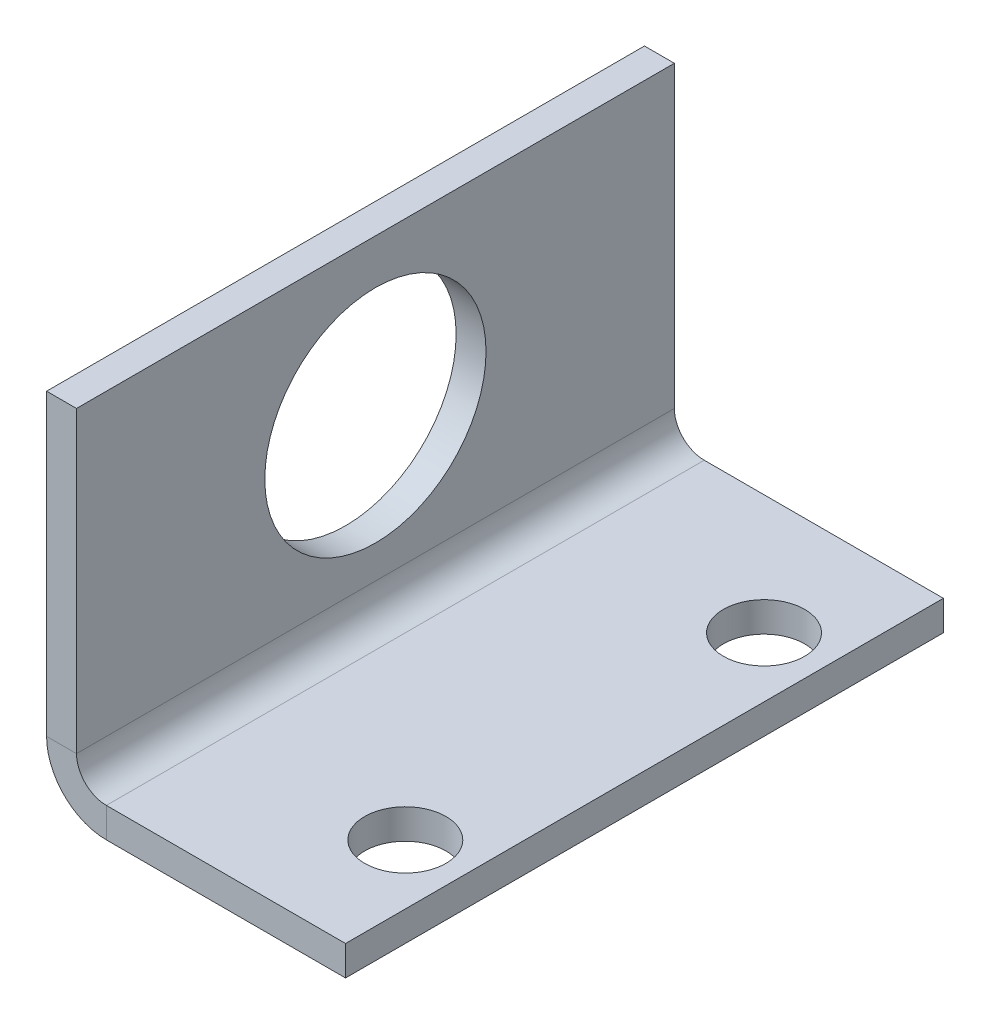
ISO-10303-21;
HEADER;
FILE_DESCRIPTION(('STEP AP214'),'2;1');
FILE_NAME('part.step','',(''),(''),'','','');
FILE_SCHEMA(('AUTOMOTIVE_DESIGN { 1 0 10303 214 1 1 1 1 }'));
ENDSEC;
DATA;
#1=APPLICATION_CONTEXT('core data for automotive mechanical design processes');
#2=APPLICATION_PROTOCOL_DEFINITION('international standard','automotive_design',2000,#1);
#3=PRODUCT_CONTEXT('',#1,'mechanical');
#4=PRODUCT('Part','Part','',(#3));
#5=PRODUCT_RELATED_PRODUCT_CATEGORY('part','',(#4));
#6=PRODUCT_DEFINITION_FORMATION('','',#4);
#7=PRODUCT_DEFINITION_CONTEXT('part definition',#1,'design');
#8=PRODUCT_DEFINITION('design','',#6,#7);
#9=PRODUCT_DEFINITION_SHAPE('','',#8);
#10=(LENGTH_UNIT() NAMED_UNIT(*) SI_UNIT(.MILLI.,.METRE.));
#11=(NAMED_UNIT(*) PLANE_ANGLE_UNIT() SI_UNIT($,.RADIAN.));
#12=(NAMED_UNIT(*) SI_UNIT($,.STERADIAN.) SOLID_ANGLE_UNIT());
#13=UNCERTAINTY_MEASURE_WITH_UNIT(LENGTH_MEASURE(1.E-05),#10,'distance_accuracy_value','');
#14=(GEOMETRIC_REPRESENTATION_CONTEXT(3) GLOBAL_UNCERTAINTY_ASSIGNED_CONTEXT((#13)) GLOBAL_UNIT_ASSIGNED_CONTEXT((#10,
#11,#12)) REPRESENTATION_CONTEXT('',''));
#15=CARTESIAN_POINT('',(0.,0.,0.));
#16=DIRECTION('',(0.,0.,1.));
#17=DIRECTION('',(1.,0.,0.));
#18=AXIS2_PLACEMENT_3D('',#15,#16,#17);
#19=CARTESIAN_POINT('',(0.,5.,50.));
#20=DIRECTION('',(0.,0.,1.));
#21=DIRECTION('',(1.,0.,0.));
#22=AXIS2_PLACEMENT_3D('',#19,#20,#21);
#23=PLANE('',#22);
#24=DIRECTION('',(1.,0.,0.));
#25=VECTOR('',#24,1.);
#26=CARTESIAN_POINT('',(0.,5.,50.));
#27=LINE('',#26,#25);
#28=CARTESIAN_POINT('',(0.,5.,50.));
#29=VERTEX_POINT('',#28);
#30=CARTESIAN_POINT('',(2.5,5.,50.));
#31=VERTEX_POINT('',#30);
#32=EDGE_CURVE('E11',#29,#31,#27,.T.);
#33=ORIENTED_EDGE('',*,*,#32,.F.);
#34=CARTESIAN_POINT('',(5.,5.,50.));
#35=DIRECTION('',(0.,0.,-1.));
#36=DIRECTION('',(-1.,0.,0.));
#37=AXIS2_PLACEMENT_3D('',#34,#35,#36);
#38=CIRCLE('',#37,5.);
#39=CARTESIAN_POINT('',(5.,0.,50.));
#40=VERTEX_POINT('',#39);
#41=EDGE_CURVE('E182',#29,#40,#38,.F.);
#42=ORIENTED_EDGE('',*,*,#41,.T.);
#43=DIRECTION('',(0.,-1.,0.));
#44=VECTOR('',#43,1.);
#45=CARTESIAN_POINT('',(5.,2.5,50.));
#46=LINE('',#45,#44);
#47=CARTESIAN_POINT('',(5.,2.5,50.));
#48=VERTEX_POINT('',#47);
#49=EDGE_CURVE('E48',#48,#40,#46,.T.);
#50=ORIENTED_EDGE('',*,*,#49,.F.);
#51=CARTESIAN_POINT('',(5.,5.,50.));
#52=DIRECTION('',(0.,0.,1.));
#53=DIRECTION('',(1.,0.,0.));
#54=AXIS2_PLACEMENT_3D('',#51,#52,#53);
#55=CIRCLE('',#54,2.5);
#56=EDGE_CURVE('E167',#31,#48,#55,.T.);
#57=ORIENTED_EDGE('',*,*,#56,.F.);
#58=EDGE_LOOP('',(#33,#42,#50,#57));
#59=FACE_BOUND('',#58,.T.);
#60=ADVANCED_FACE('F40',(#59),#23,.T.);
#61=CARTESIAN_POINT('',(5.,2.5,50.));
#62=DIRECTION('',(0.,0.,1.));
#63=DIRECTION('',(1.,0.,0.));
#64=AXIS2_PLACEMENT_3D('',#61,#62,#63);
#65=PLANE('',#64);
#66=DIRECTION('',(0.,-1.,0.));
#67=VECTOR('',#66,1.);
#68=CARTESIAN_POINT('',(0.,30.,50.));
#69=LINE('',#68,#67);
#70=CARTESIAN_POINT('',(0.,30.,50.));
#71=VERTEX_POINT('',#70);
#72=EDGE_CURVE('E179',#71,#29,#69,.T.);
#73=ORIENTED_EDGE('',*,*,#72,.T.);
#74=ORIENTED_EDGE('',*,*,#32,.T.);
#75=DIRECTION('',(0.,-1.,0.));
#76=VECTOR('',#75,1.);
#77=CARTESIAN_POINT('',(2.5,30.,50.));
#78=LINE('',#77,#76);
#79=CARTESIAN_POINT('',(2.5,30.,50.));
#80=VERTEX_POINT('',#79);
#81=EDGE_CURVE('E171',#80,#31,#78,.T.);
#82=ORIENTED_EDGE('',*,*,#81,.F.);
#83=DIRECTION('',(1.,0.,0.));
#84=VECTOR('',#83,1.);
#85=CARTESIAN_POINT('',(0.,30.,50.));
#86=LINE('',#85,#84);
#87=EDGE_CURVE('E175',#71,#80,#86,.T.);
#88=ORIENTED_EDGE('',*,*,#87,.F.);
#89=EDGE_LOOP('',(#73,#74,#82,#88));
#90=FACE_BOUND('',#89,.T.);
#91=ADVANCED_FACE('F257',(#90),#65,.T.);
#92=CARTESIAN_POINT('',(5.,0.,0.));
#93=DIRECTION('',(0.,0.,-1.));
#94=DIRECTION('',(-1.,0.,0.));
#95=AXIS2_PLACEMENT_3D('',#92,#93,#94);
#96=PLANE('',#95);
#97=DIRECTION('',(0.,1.,0.));
#98=VECTOR('',#97,1.);
#99=CARTESIAN_POINT('',(5.,0.,0.));
#100=LINE('',#99,#98);
#101=CARTESIAN_POINT('',(5.,0.,0.));
#102=VERTEX_POINT('',#101);
#103=CARTESIAN_POINT('',(5.,2.5,0.));
#104=VERTEX_POINT('',#103);
#105=EDGE_CURVE('E208',#102,#104,#100,.T.);
#106=ORIENTED_EDGE('',*,*,#105,.F.);
#107=CARTESIAN_POINT('',(5.,5.,0.));
#108=DIRECTION('',(0.,0.,-1.));
#109=DIRECTION('',(-1.,0.,0.));
#110=AXIS2_PLACEMENT_3D('',#107,#108,#109);
#111=CIRCLE('',#110,5.);
#112=CARTESIAN_POINT('',(0.,5.,0.));
#113=VERTEX_POINT('',#112);
#114=EDGE_CURVE('E154',#113,#102,#111,.F.);
#115=ORIENTED_EDGE('',*,*,#114,.F.);
#116=DIRECTION('',(-1.,0.,0.));
#117=VECTOR('',#116,1.);
#118=CARTESIAN_POINT('',(2.5,5.,0.));
#119=LINE('',#118,#117);
#120=CARTESIAN_POINT('',(2.5,5.,0.));
#121=VERTEX_POINT('',#120);
#122=EDGE_CURVE('E114',#121,#113,#119,.T.);
#123=ORIENTED_EDGE('',*,*,#122,.F.);
#124=CARTESIAN_POINT('',(5.,5.,0.));
#125=DIRECTION('',(0.,0.,1.));
#126=DIRECTION('',(1.,0.,0.));
#127=AXIS2_PLACEMENT_3D('',#124,#125,#126);
#128=CIRCLE('',#127,2.5);
#129=EDGE_CURVE('E135',#121,#104,#128,.T.);
#130=ORIENTED_EDGE('',*,*,#129,.T.);
#131=EDGE_LOOP('',(#106,#115,#123,#130));
#132=FACE_BOUND('',#131,.T.);
#133=ADVANCED_FACE('F281',(#132),#96,.T.);
#134=CARTESIAN_POINT('',(2.5,5.,0.));
#135=DIRECTION('',(0.,0.,-1.));
#136=DIRECTION('',(-1.,0.,0.));
#137=AXIS2_PLACEMENT_3D('',#134,#135,#136);
#138=PLANE('',#137);
#139=DIRECTION('',(1.,0.,0.));
#140=VECTOR('',#139,1.);
#141=CARTESIAN_POINT('',(0.,0.,0.));
#142=LINE('',#141,#140);
#143=CARTESIAN_POINT('',(25.,0.,0.));
#144=VERTEX_POINT('',#143);
#145=EDGE_CURVE('E119',#102,#144,#142,.T.);
#146=ORIENTED_EDGE('',*,*,#145,.F.);
#147=ORIENTED_EDGE('',*,*,#105,.T.);
#148=DIRECTION('',(1.,0.,0.));
#149=VECTOR('',#148,1.);
#150=CARTESIAN_POINT('',(0.,2.5,0.));
#151=LINE('',#150,#149);
#152=CARTESIAN_POINT('',(25.,2.5,0.));
#153=VERTEX_POINT('',#152);
#154=EDGE_CURVE('E129',#104,#153,#151,.T.);
#155=ORIENTED_EDGE('',*,*,#154,.T.);
#156=DIRECTION('',(0.,-1.,0.));
#157=VECTOR('',#156,1.);
#158=CARTESIAN_POINT('',(25.,2.5,0.));
#159=LINE('',#158,#157);
#160=EDGE_CURVE('E107',#153,#144,#159,.T.);
#161=ORIENTED_EDGE('',*,*,#160,.T.);
#162=EDGE_LOOP('',(#146,#147,#155,#161));
#163=FACE_BOUND('',#162,.T.);
#164=ADVANCED_FACE('F127',(#163),#138,.T.);
#165=CARTESIAN_POINT('',(0.,0.,50.));
#166=DIRECTION('',(0.,1.,0.));
#167=DIRECTION('',(0.,0.,1.));
#168=AXIS2_PLACEMENT_3D('',#165,#166,#167);
#169=PLANE('',#168);
#170=CARTESIAN_POINT('',(20.,0.,10.));
#171=DIRECTION('',(0.,1.,0.));
#172=DIRECTION('',(0.,0.,1.));
#173=AXIS2_PLACEMENT_3D('',#170,#171,#172);
#174=CIRCLE('',#173,3.4);
#175=CARTESIAN_POINT('',(20.,0.,13.4));
#176=VERTEX_POINT('',#175);
#177=EDGE_CURVE('E219',#176,#176,#174,.T.);
#178=ORIENTED_EDGE('',*,*,#177,.T.);
#179=EDGE_LOOP('',(#178));
#180=FACE_BOUND('',#179,.T.);
#181=CARTESIAN_POINT('',(20.,0.,40.));
#182=DIRECTION('',(0.,1.,0.));
#183=DIRECTION('',(0.,0.,1.));
#184=AXIS2_PLACEMENT_3D('',#181,#182,#183);
#185=CIRCLE('',#184,3.4);
#186=CARTESIAN_POINT('',(20.,0.,43.4));
#187=VERTEX_POINT('',#186);
#188=EDGE_CURVE('E125',#187,#187,#185,.T.);
#189=ORIENTED_EDGE('',*,*,#188,.T.);
#190=EDGE_LOOP('',(#189));
#191=FACE_BOUND('',#190,.T.);
#192=ORIENTED_EDGE('',*,*,#145,.T.);
#193=DIRECTION('',(0.,0.,-1.));
#194=VECTOR('',#193,1.);
#195=CARTESIAN_POINT('',(25.,0.,50.));
#196=LINE('',#195,#194);
#197=CARTESIAN_POINT('',(25.,0.,50.));
#198=VERTEX_POINT('',#197);
#199=EDGE_CURVE('E103',#198,#144,#196,.T.);
#200=ORIENTED_EDGE('',*,*,#199,.F.);
#201=DIRECTION('',(1.,0.,0.));
#202=VECTOR('',#201,1.);
#203=CARTESIAN_POINT('',(0.,0.,50.));
#204=LINE('',#203,#202);
#205=EDGE_CURVE('E158',#40,#198,#204,.T.);
#206=ORIENTED_EDGE('',*,*,#205,.F.);
#207=DIRECTION('',(0.,0.,-1.));
#208=VECTOR('',#207,1.);
#209=CARTESIAN_POINT('',(5.,0.,50.));
#210=LINE('',#209,#208);
#211=EDGE_CURVE('E122',#40,#102,#210,.T.);
#212=ORIENTED_EDGE('',*,*,#211,.T.);
#213=EDGE_LOOP('',(#192,#200,#206,#212));
#214=FACE_BOUND('',#213,.T.);
#215=ADVANCED_FACE('F120',(#180,#191,#214),#169,.F.);
#216=CARTESIAN_POINT('',(25.,2.5,50.));
#217=DIRECTION('',(1.,0.,0.));
#218=DIRECTION('',(0.,0.,-1.));
#219=AXIS2_PLACEMENT_3D('',#216,#217,#218);
#220=PLANE('',#219);
#221=ORIENTED_EDGE('',*,*,#160,.F.);
#222=DIRECTION('',(0.,0.,-1.));
#223=VECTOR('',#222,1.);
#224=CARTESIAN_POINT('',(25.,2.5,50.));
#225=LINE('',#224,#223);
#226=CARTESIAN_POINT('',(25.,2.5,50.));
#227=VERTEX_POINT('',#226);
#228=EDGE_CURVE('E115',#227,#153,#225,.T.);
#229=ORIENTED_EDGE('',*,*,#228,.F.);
#230=DIRECTION('',(0.,-1.,0.));
#231=VECTOR('',#230,1.);
#232=CARTESIAN_POINT('',(25.,2.5,50.));
#233=LINE('',#232,#231);
#234=EDGE_CURVE('E110',#227,#198,#233,.T.);
#235=ORIENTED_EDGE('',*,*,#234,.T.);
#236=ORIENTED_EDGE('',*,*,#199,.T.);
#237=EDGE_LOOP('',(#221,#229,#235,#236));
#238=FACE_BOUND('',#237,.T.);
#239=ADVANCED_FACE('F105',(#238),#220,.T.);
#240=CARTESIAN_POINT('',(0.,2.5,50.));
#241=DIRECTION('',(0.,1.,0.));
#242=DIRECTION('',(0.,0.,1.));
#243=AXIS2_PLACEMENT_3D('',#240,#241,#242);
#244=PLANE('',#243);
#245=CARTESIAN_POINT('',(20.,2.5,10.));
#246=DIRECTION('',(0.,1.,0.));
#247=DIRECTION('',(0.,0.,1.));
#248=AXIS2_PLACEMENT_3D('',#245,#246,#247);
#249=CIRCLE('',#248,3.39999999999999);
#250=CARTESIAN_POINT('',(20.,2.5,13.4));
#251=VERTEX_POINT('',#250);
#252=EDGE_CURVE('E228',#251,#251,#249,.T.);
#253=ORIENTED_EDGE('',*,*,#252,.F.);
#254=EDGE_LOOP('',(#253));
#255=FACE_BOUND('',#254,.T.);
#256=CARTESIAN_POINT('',(20.,2.5,40.));
#257=DIRECTION('',(0.,1.,0.));
#258=DIRECTION('',(0.,0.,1.));
#259=AXIS2_PLACEMENT_3D('',#256,#257,#258);
#260=CIRCLE('',#259,3.39999999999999);
#261=CARTESIAN_POINT('',(20.,2.5,43.4));
#262=VERTEX_POINT('',#261);
#263=EDGE_CURVE('E217',#262,#262,#260,.T.);
#264=ORIENTED_EDGE('',*,*,#263,.F.);
#265=EDGE_LOOP('',(#264));
#266=FACE_BOUND('',#265,.T.);
#267=ORIENTED_EDGE('',*,*,#154,.F.);
#268=DIRECTION('',(0.,0.,-1.));
#269=VECTOR('',#268,1.);
#270=CARTESIAN_POINT('',(5.,2.5,50.));
#271=LINE('',#270,#269);
#272=EDGE_CURVE('E201',#48,#104,#271,.T.);
#273=ORIENTED_EDGE('',*,*,#272,.F.);
#274=DIRECTION('',(1.,0.,0.));
#275=VECTOR('',#274,1.);
#276=CARTESIAN_POINT('',(0.,2.5,50.));
#277=LINE('',#276,#275);
#278=EDGE_CURVE('E163',#48,#227,#277,.T.);
#279=ORIENTED_EDGE('',*,*,#278,.T.);
#280=ORIENTED_EDGE('',*,*,#228,.T.);
#281=EDGE_LOOP('',(#267,#273,#279,#280));
#282=FACE_BOUND('',#281,.T.);
#283=ADVANCED_FACE('F263',(#255,#266,#282),#244,.T.);
#284=CARTESIAN_POINT('',(5.,5.,50.));
#285=DIRECTION('',(0.,0.,-1.));
#286=DIRECTION('',(-1.,0.,0.));
#287=AXIS2_PLACEMENT_3D('',#284,#285,#286);
#288=CYLINDRICAL_SURFACE('',#287,2.5);
#289=ORIENTED_EDGE('',*,*,#129,.F.);
#290=DIRECTION('',(0.,0.,-1.));
#291=VECTOR('',#290,1.);
#292=CARTESIAN_POINT('',(2.5,5.,50.));
#293=LINE('',#292,#291);
#294=EDGE_CURVE('E197',#31,#121,#293,.T.);
#295=ORIENTED_EDGE('',*,*,#294,.F.);
#296=ORIENTED_EDGE('',*,*,#56,.T.);
#297=ORIENTED_EDGE('',*,*,#272,.T.);
#298=EDGE_LOOP('',(#289,#295,#296,#297));
#299=FACE_BOUND('',#298,.T.);
#300=ADVANCED_FACE('F243',(#299),#288,.F.);
#301=CARTESIAN_POINT('',(2.5,30.,50.));
#302=DIRECTION('',(1.,0.,0.));
#303=DIRECTION('',(0.,1.,0.));
#304=AXIS2_PLACEMENT_3D('',#301,#302,#303);
#305=PLANE('',#304);
#306=CARTESIAN_POINT('',(2.5,17.,25.));
#307=DIRECTION('',(1.,0.,0.));
#308=DIRECTION('',(0.,1.,0.));
#309=AXIS2_PLACEMENT_3D('',#306,#307,#308);
#310=CIRCLE('',#309,9.25);
#311=CARTESIAN_POINT('',(2.5,26.25,25.));
#312=VERTEX_POINT('',#311);
#313=EDGE_CURVE('E215',#312,#312,#310,.T.);
#314=ORIENTED_EDGE('',*,*,#313,.F.);
#315=EDGE_LOOP('',(#314));
#316=FACE_BOUND('',#315,.T.);
#317=DIRECTION('',(0.,-1.,0.));
#318=VECTOR('',#317,1.);
#319=CARTESIAN_POINT('',(2.5,30.,0.));
#320=LINE('',#319,#318);
#321=CARTESIAN_POINT('',(2.5,30.,0.));
#322=VERTEX_POINT('',#321);
#323=EDGE_CURVE('E142',#322,#121,#320,.T.);
#324=ORIENTED_EDGE('',*,*,#323,.F.);
#325=DIRECTION('',(0.,0.,-1.));
#326=VECTOR('',#325,1.);
#327=CARTESIAN_POINT('',(2.5,30.,50.));
#328=LINE('',#327,#326);
#329=EDGE_CURVE('E194',#80,#322,#328,.T.);
#330=ORIENTED_EDGE('',*,*,#329,.F.);
#331=ORIENTED_EDGE('',*,*,#81,.T.);
#332=ORIENTED_EDGE('',*,*,#294,.T.);
#333=EDGE_LOOP('',(#324,#330,#331,#332));
#334=FACE_BOUND('',#333,.T.);
#335=ADVANCED_FACE('F239',(#316,#334),#305,.T.);
#336=CARTESIAN_POINT('',(0.,30.,50.));
#337=DIRECTION('',(0.,1.,0.));
#338=DIRECTION('',(0.,0.,1.));
#339=AXIS2_PLACEMENT_3D('',#336,#337,#338);
#340=PLANE('',#339);
#341=DIRECTION('',(1.,0.,0.));
#342=VECTOR('',#341,1.);
#343=CARTESIAN_POINT('',(0.,30.,0.));
#344=LINE('',#343,#342);
#345=CARTESIAN_POINT('',(0.,30.,0.));
#346=VERTEX_POINT('',#345);
#347=EDGE_CURVE('E146',#346,#322,#344,.T.);
#348=ORIENTED_EDGE('',*,*,#347,.F.);
#349=DIRECTION('',(0.,0.,-1.));
#350=VECTOR('',#349,1.);
#351=CARTESIAN_POINT('',(0.,30.,50.));
#352=LINE('',#351,#350);
#353=EDGE_CURVE('E191',#71,#346,#352,.T.);
#354=ORIENTED_EDGE('',*,*,#353,.F.);
#355=ORIENTED_EDGE('',*,*,#87,.T.);
#356=ORIENTED_EDGE('',*,*,#329,.T.);
#357=EDGE_LOOP('',(#348,#354,#355,#356));
#358=FACE_BOUND('',#357,.T.);
#359=ADVANCED_FACE('F242',(#358),#340,.T.);
#360=CARTESIAN_POINT('',(0.,30.,50.));
#361=DIRECTION('',(1.,0.,0.));
#362=DIRECTION('',(0.,1.,0.));
#363=AXIS2_PLACEMENT_3D('',#360,#361,#362);
#364=PLANE('',#363);
#365=CARTESIAN_POINT('',(0.,17.,25.));
#366=DIRECTION('',(-1.,0.,0.));
#367=DIRECTION('',(0.,0.,1.));
#368=AXIS2_PLACEMENT_3D('',#365,#366,#367);
#369=CIRCLE('',#368,9.25);
#370=CARTESIAN_POINT('',(0.,17.,34.25));
#371=VERTEX_POINT('',#370);
#372=EDGE_CURVE('E212',#371,#371,#369,.T.);
#373=ORIENTED_EDGE('',*,*,#372,.F.);
#374=EDGE_LOOP('',(#373));
#375=FACE_BOUND('',#374,.T.);
#376=DIRECTION('',(0.,-1.,0.));
#377=VECTOR('',#376,1.);
#378=CARTESIAN_POINT('',(0.,30.,0.));
#379=LINE('',#378,#377);
#380=EDGE_CURVE('E150',#346,#113,#379,.T.);
#381=ORIENTED_EDGE('',*,*,#380,.T.);
#382=DIRECTION('',(0.,0.,-1.));
#383=VECTOR('',#382,1.);
#384=CARTESIAN_POINT('',(0.,5.,50.));
#385=LINE('',#384,#383);
#386=EDGE_CURVE('E187',#29,#113,#385,.T.);
#387=ORIENTED_EDGE('',*,*,#386,.F.);
#388=ORIENTED_EDGE('',*,*,#72,.F.);
#389=ORIENTED_EDGE('',*,*,#353,.T.);
#390=EDGE_LOOP('',(#381,#387,#388,#389));
#391=FACE_BOUND('',#390,.T.);
#392=ADVANCED_FACE('F274',(#375,#391),#364,.F.);
#393=CARTESIAN_POINT('',(5.,5.,50.));
#394=DIRECTION('',(0.,0.,-1.));
#395=DIRECTION('',(-1.,0.,0.));
#396=AXIS2_PLACEMENT_3D('',#393,#394,#395);
#397=CYLINDRICAL_SURFACE('',#396,5.);
#398=ORIENTED_EDGE('',*,*,#114,.T.);
#399=ORIENTED_EDGE('',*,*,#211,.F.);
#400=ORIENTED_EDGE('',*,*,#41,.F.);
#401=ORIENTED_EDGE('',*,*,#386,.T.);
#402=EDGE_LOOP('',(#398,#399,#400,#401));
#403=FACE_BOUND('',#402,.T.);
#404=ADVANCED_FACE('F266',(#403),#397,.T.);
#405=CARTESIAN_POINT('',(5.,5.,50.));
#406=DIRECTION('',(0.,0.,1.));
#407=DIRECTION('',(1.,0.,0.));
#408=AXIS2_PLACEMENT_3D('',#405,#406,#407);
#409=PLANE('',#408);
#410=ORIENTED_EDGE('',*,*,#205,.T.);
#411=ORIENTED_EDGE('',*,*,#234,.F.);
#412=ORIENTED_EDGE('',*,*,#278,.F.);
#413=ORIENTED_EDGE('',*,*,#49,.T.);
#414=EDGE_LOOP('',(#410,#411,#412,#413));
#415=FACE_BOUND('',#414,.T.);
#416=ADVANCED_FACE('F264',(#415),#409,.T.);
#417=CARTESIAN_POINT('',(5.,5.,0.));
#418=DIRECTION('',(0.,0.,1.));
#419=DIRECTION('',(1.,0.,0.));
#420=AXIS2_PLACEMENT_3D('',#417,#418,#419);
#421=PLANE('',#420);
#422=ORIENTED_EDGE('',*,*,#323,.T.);
#423=ORIENTED_EDGE('',*,*,#122,.T.);
#424=ORIENTED_EDGE('',*,*,#380,.F.);
#425=ORIENTED_EDGE('',*,*,#347,.T.);
#426=EDGE_LOOP('',(#422,#423,#424,#425));
#427=FACE_BOUND('',#426,.T.);
#428=ADVANCED_FACE('F252',(#427),#421,.F.);
#429=CARTESIAN_POINT('',(20.,2.5,40.));
#430=DIRECTION('',(0.,1.,0.));
#431=DIRECTION('',(0.,0.,1.));
#432=AXIS2_PLACEMENT_3D('',#429,#430,#431);
#433=CYLINDRICAL_SURFACE('',#432,3.4);
#434=ORIENTED_EDGE('',*,*,#188,.F.);
#435=EDGE_LOOP('',(#434));
#436=FACE_BOUND('',#435,.T.);
#437=ORIENTED_EDGE('',*,*,#263,.T.);
#438=EDGE_LOOP('',(#437));
#439=FACE_BOUND('',#438,.T.);
#440=ADVANCED_FACE('F272',(#436,#439),#433,.F.);
#441=CARTESIAN_POINT('',(20.,2.5,10.));
#442=DIRECTION('',(0.,1.,0.));
#443=DIRECTION('',(0.,0.,1.));
#444=AXIS2_PLACEMENT_3D('',#441,#442,#443);
#445=CYLINDRICAL_SURFACE('',#444,3.4);
#446=ORIENTED_EDGE('',*,*,#177,.F.);
#447=EDGE_LOOP('',(#446));
#448=FACE_BOUND('',#447,.T.);
#449=ORIENTED_EDGE('',*,*,#252,.T.);
#450=EDGE_LOOP('',(#449));
#451=FACE_BOUND('',#450,.T.);
#452=ADVANCED_FACE('F310',(#448,#451),#445,.F.);
#453=CARTESIAN_POINT('',(0.,17.,25.));
#454=DIRECTION('',(-1.,0.,0.));
#455=DIRECTION('',(0.,0.,1.));
#456=AXIS2_PLACEMENT_3D('',#453,#454,#455);
#457=CYLINDRICAL_SURFACE('',#456,9.25);
#458=ORIENTED_EDGE('',*,*,#313,.T.);
#459=EDGE_LOOP('',(#458));
#460=FACE_BOUND('',#459,.T.);
#461=ORIENTED_EDGE('',*,*,#372,.T.);
#462=EDGE_LOOP('',(#461));
#463=FACE_BOUND('',#462,.T.);
#464=ADVANCED_FACE('F236',(#460,#463),#457,.F.);
#465=CLOSED_SHELL('',(#60,#91,#133,#164,#215,#239,#283,#300,#335,#359,#392,#404,#416,#428,#440,
#452,#464));
#466=MANIFOLD_SOLID_BREP('B2',#465);
#467=ADVANCED_BREP_SHAPE_REPRESENTATION('',(#18,#466),#14);
#468=SHAPE_DEFINITION_REPRESENTATION(#9,#467);
ENDSEC;
END-ISO-10303-21;
